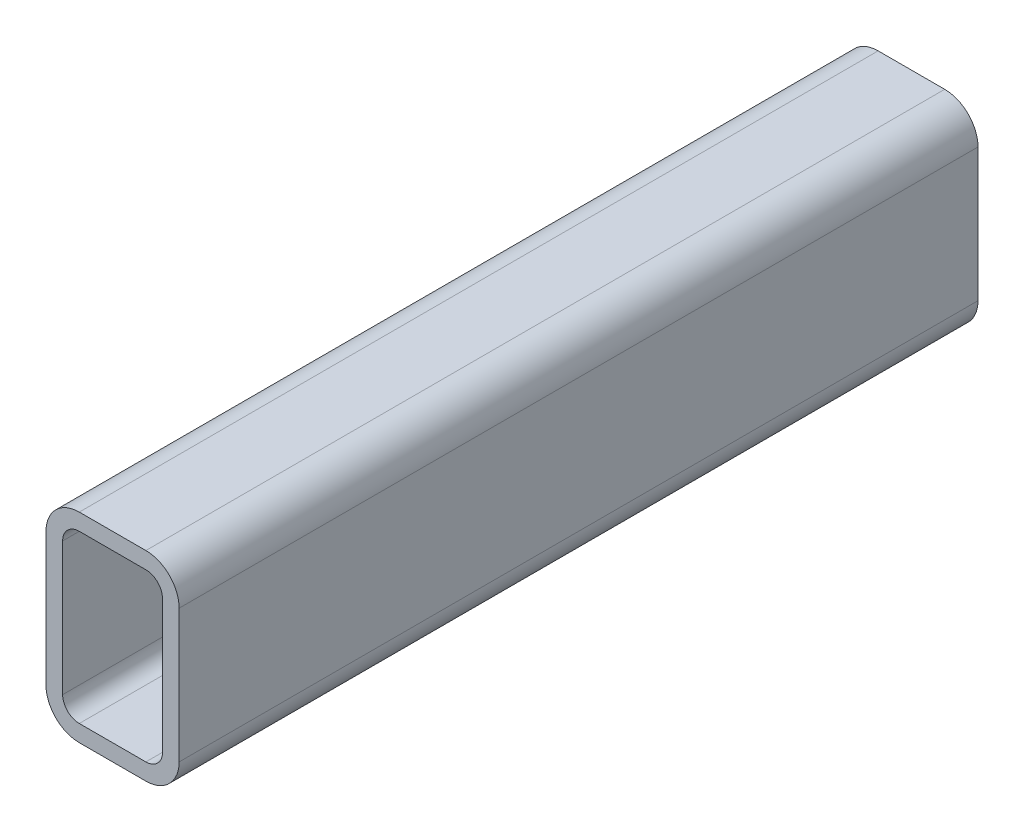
ISO-10303-21;
HEADER;
FILE_DESCRIPTION(('STEP AP214'),'2;1');
FILE_NAME('part.step','',(''),(''),'','','');
FILE_SCHEMA(('AUTOMOTIVE_DESIGN { 1 0 10303 214 1 1 1 1 }'));
ENDSEC;
DATA;
#1=APPLICATION_CONTEXT('core data for automotive mechanical design processes');
#2=APPLICATION_PROTOCOL_DEFINITION('international standard','automotive_design',2000,#1);
#3=PRODUCT_CONTEXT('',#1,'mechanical');
#4=PRODUCT('Part','Part','',(#3));
#5=PRODUCT_RELATED_PRODUCT_CATEGORY('part','',(#4));
#6=PRODUCT_DEFINITION_FORMATION('','',#4);
#7=PRODUCT_DEFINITION_CONTEXT('part definition',#1,'design');
#8=PRODUCT_DEFINITION('design','',#6,#7);
#9=PRODUCT_DEFINITION_SHAPE('','',#8);
#10=(LENGTH_UNIT() NAMED_UNIT(*) SI_UNIT(.MILLI.,.METRE.));
#11=(NAMED_UNIT(*) PLANE_ANGLE_UNIT() SI_UNIT($,.RADIAN.));
#12=(NAMED_UNIT(*) SI_UNIT($,.STERADIAN.) SOLID_ANGLE_UNIT());
#13=UNCERTAINTY_MEASURE_WITH_UNIT(LENGTH_MEASURE(1.E-05),#10,'distance_accuracy_value','');
#14=(GEOMETRIC_REPRESENTATION_CONTEXT(3) GLOBAL_UNCERTAINTY_ASSIGNED_CONTEXT((#13)) GLOBAL_UNIT_ASSIGNED_CONTEXT((#10,
#11,#12)) REPRESENTATION_CONTEXT('',''));
#15=CARTESIAN_POINT('',(0.,0.,0.));
#16=DIRECTION('',(0.,0.,1.));
#17=DIRECTION('',(1.,0.,0.));
#18=AXIS2_PLACEMENT_3D('',#15,#16,#17);
#19=CARTESIAN_POINT('',(12.7,63.5,304.8));
#20=DIRECTION('',(0.,0.,1.));
#21=DIRECTION('',(1.,0.,0.));
#22=AXIS2_PLACEMENT_3D('',#19,#20,#21);
#23=PLANE('',#22);
#24=CARTESIAN_POINT('',(12.7,63.5,304.8));
#25=DIRECTION('',(0.,0.,1.));
#26=DIRECTION('',(1.,0.,0.));
#27=AXIS2_PLACEMENT_3D('',#24,#25,#26);
#28=CIRCLE('',#27,12.7);
#29=CARTESIAN_POINT('',(12.7,76.2,304.8));
#30=VERTEX_POINT('',#29);
#31=CARTESIAN_POINT('',(0.,63.5,304.8));
#32=VERTEX_POINT('',#31);
#33=EDGE_CURVE('E211',#30,#32,#28,.T.);
#34=ORIENTED_EDGE('',*,*,#33,.T.);
#35=DIRECTION('',(0.,-1.,0.));
#36=VECTOR('',#35,1.);
#37=CARTESIAN_POINT('',(0.,12.7,304.8));
#38=LINE('',#37,#36);
#39=CARTESIAN_POINT('',(0.,12.7,304.8));
#40=VERTEX_POINT('',#39);
#41=EDGE_CURVE('E214',#32,#40,#38,.T.);
#42=ORIENTED_EDGE('',*,*,#41,.T.);
#43=CARTESIAN_POINT('',(12.7,12.7,304.8));
#44=DIRECTION('',(0.,0.,1.));
#45=DIRECTION('',(1.,0.,0.));
#46=AXIS2_PLACEMENT_3D('',#43,#44,#45);
#47=CIRCLE('',#46,12.7);
#48=CARTESIAN_POINT('',(12.7,0.,304.8));
#49=VERTEX_POINT('',#48);
#50=EDGE_CURVE('E217',#40,#49,#47,.T.);
#51=ORIENTED_EDGE('',*,*,#50,.T.);
#52=DIRECTION('',(1.,0.,0.));
#53=VECTOR('',#52,1.);
#54=CARTESIAN_POINT('',(38.1,0.,304.8));
#55=LINE('',#54,#53);
#56=CARTESIAN_POINT('',(38.1,0.,304.8));
#57=VERTEX_POINT('',#56);
#58=EDGE_CURVE('E219',#49,#57,#55,.T.);
#59=ORIENTED_EDGE('',*,*,#58,.T.);
#60=CARTESIAN_POINT('',(38.1,12.7,304.8));
#61=DIRECTION('',(0.,0.,1.));
#62=DIRECTION('',(1.,0.,0.));
#63=AXIS2_PLACEMENT_3D('',#60,#61,#62);
#64=CIRCLE('',#63,12.7);
#65=CARTESIAN_POINT('',(50.8,12.7,304.8));
#66=VERTEX_POINT('',#65);
#67=EDGE_CURVE('E221',#57,#66,#64,.T.);
#68=ORIENTED_EDGE('',*,*,#67,.T.);
#69=DIRECTION('',(0.,1.,0.));
#70=VECTOR('',#69,1.);
#71=CARTESIAN_POINT('',(50.8,63.5,304.8));
#72=LINE('',#71,#70);
#73=CARTESIAN_POINT('',(50.8,63.5,304.8));
#74=VERTEX_POINT('',#73);
#75=EDGE_CURVE('E223',#66,#74,#72,.T.);
#76=ORIENTED_EDGE('',*,*,#75,.T.);
#77=CARTESIAN_POINT('',(38.1,63.5,304.8));
#78=DIRECTION('',(0.,0.,1.));
#79=DIRECTION('',(1.,0.,0.));
#80=AXIS2_PLACEMENT_3D('',#77,#78,#79);
#81=CIRCLE('',#80,12.7);
#82=CARTESIAN_POINT('',(38.1,76.2,304.8));
#83=VERTEX_POINT('',#82);
#84=EDGE_CURVE('E225',#74,#83,#81,.T.);
#85=ORIENTED_EDGE('',*,*,#84,.T.);
#86=DIRECTION('',(-1.,0.,0.));
#87=VECTOR('',#86,1.);
#88=CARTESIAN_POINT('',(12.7,76.2,304.8));
#89=LINE('',#88,#87);
#90=EDGE_CURVE('E227',#83,#30,#89,.T.);
#91=ORIENTED_EDGE('',*,*,#90,.T.);
#92=EDGE_LOOP('',(#34,#42,#51,#59,#68,#76,#85,#91));
#93=FACE_BOUND('',#92,.T.);
#94=DIRECTION('',(0.,-1.,0.));
#95=VECTOR('',#94,1.);
#96=CARTESIAN_POINT('',(6.35,12.7,304.8));
#97=LINE('',#96,#95);
#98=CARTESIAN_POINT('',(6.35,63.5,304.8));
#99=VERTEX_POINT('',#98);
#100=CARTESIAN_POINT('',(6.35,12.7,304.8));
#101=VERTEX_POINT('',#100);
#102=EDGE_CURVE('E154',#99,#101,#97,.T.);
#103=ORIENTED_EDGE('',*,*,#102,.F.);
#104=CARTESIAN_POINT('',(12.7,63.5,304.8));
#105=DIRECTION('',(0.,0.,1.));
#106=DIRECTION('',(1.,0.,0.));
#107=AXIS2_PLACEMENT_3D('',#104,#105,#106);
#108=CIRCLE('',#107,6.35);
#109=CARTESIAN_POINT('',(12.7,69.85,304.8));
#110=VERTEX_POINT('',#109);
#111=EDGE_CURVE('E146',#110,#99,#108,.T.);
#112=ORIENTED_EDGE('',*,*,#111,.F.);
#113=DIRECTION('',(-1.,0.,0.));
#114=VECTOR('',#113,1.);
#115=CARTESIAN_POINT('',(12.7,69.85,304.8));
#116=LINE('',#115,#114);
#117=CARTESIAN_POINT('',(38.1,69.85,304.8));
#118=VERTEX_POINT('',#117);
#119=EDGE_CURVE('E179',#118,#110,#116,.T.);
#120=ORIENTED_EDGE('',*,*,#119,.F.);
#121=CARTESIAN_POINT('',(38.1,63.5,304.8));
#122=DIRECTION('',(0.,0.,1.));
#123=DIRECTION('',(1.,0.,0.));
#124=AXIS2_PLACEMENT_3D('',#121,#122,#123);
#125=CIRCLE('',#124,6.34999999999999);
#126=CARTESIAN_POINT('',(44.45,63.5,304.8));
#127=VERTEX_POINT('',#126);
#128=EDGE_CURVE('E177',#127,#118,#125,.T.);
#129=ORIENTED_EDGE('',*,*,#128,.F.);
#130=DIRECTION('',(0.,1.,0.));
#131=VECTOR('',#130,1.);
#132=CARTESIAN_POINT('',(44.45,63.5,304.8));
#133=LINE('',#132,#131);
#134=CARTESIAN_POINT('',(44.45,12.7,304.8));
#135=VERTEX_POINT('',#134);
#136=EDGE_CURVE('E175',#135,#127,#133,.T.);
#137=ORIENTED_EDGE('',*,*,#136,.F.);
#138=CARTESIAN_POINT('',(38.1,12.7,304.8));
#139=DIRECTION('',(0.,0.,1.));
#140=DIRECTION('',(1.,0.,0.));
#141=AXIS2_PLACEMENT_3D('',#138,#139,#140);
#142=CIRCLE('',#141,6.35);
#143=CARTESIAN_POINT('',(38.1,6.35000000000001,304.8));
#144=VERTEX_POINT('',#143);
#145=EDGE_CURVE('E173',#144,#135,#142,.T.);
#146=ORIENTED_EDGE('',*,*,#145,.F.);
#147=DIRECTION('',(1.,0.,0.));
#148=VECTOR('',#147,1.);
#149=CARTESIAN_POINT('',(38.1,6.35000000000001,304.8));
#150=LINE('',#149,#148);
#151=CARTESIAN_POINT('',(12.7,6.35000000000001,304.8));
#152=VERTEX_POINT('',#151);
#153=EDGE_CURVE('E169',#152,#144,#150,.T.);
#154=ORIENTED_EDGE('',*,*,#153,.F.);
#155=CARTESIAN_POINT('',(12.7,12.7,304.8));
#156=DIRECTION('',(0.,0.,1.));
#157=DIRECTION('',(1.,0.,0.));
#158=AXIS2_PLACEMENT_3D('',#155,#156,#157);
#159=CIRCLE('',#158,6.35);
#160=EDGE_CURVE('E167',#101,#152,#159,.T.);
#161=ORIENTED_EDGE('',*,*,#160,.F.);
#162=EDGE_LOOP('',(#103,#112,#120,#129,#137,#146,#154,#161));
#163=FACE_BOUND('',#162,.T.);
#164=ADVANCED_FACE('F33',(#93,#163),#23,.T.);
#165=CARTESIAN_POINT('',(12.7,63.5,0.));
#166=DIRECTION('',(0.,0.,1.));
#167=DIRECTION('',(1.,0.,0.));
#168=AXIS2_PLACEMENT_3D('',#165,#166,#167);
#169=PLANE('',#168);
#170=CARTESIAN_POINT('',(12.7,63.5,0.));
#171=DIRECTION('',(0.,0.,1.));
#172=DIRECTION('',(1.,0.,0.));
#173=AXIS2_PLACEMENT_3D('',#170,#171,#172);
#174=CIRCLE('',#173,12.7);
#175=CARTESIAN_POINT('',(12.7,76.2,0.));
#176=VERTEX_POINT('',#175);
#177=CARTESIAN_POINT('',(0.,63.5,0.));
#178=VERTEX_POINT('',#177);
#179=EDGE_CURVE('E162',#176,#178,#174,.T.);
#180=ORIENTED_EDGE('',*,*,#179,.F.);
#181=DIRECTION('',(-1.,0.,0.));
#182=VECTOR('',#181,1.);
#183=CARTESIAN_POINT('',(12.7,76.2,0.));
#184=LINE('',#183,#182);
#185=CARTESIAN_POINT('',(38.1,76.2,0.));
#186=VERTEX_POINT('',#185);
#187=EDGE_CURVE('E215',#186,#176,#184,.T.);
#188=ORIENTED_EDGE('',*,*,#187,.F.);
#189=CARTESIAN_POINT('',(38.1,63.5,0.));
#190=DIRECTION('',(0.,0.,1.));
#191=DIRECTION('',(1.,0.,0.));
#192=AXIS2_PLACEMENT_3D('',#189,#190,#191);
#193=CIRCLE('',#192,12.7);
#194=CARTESIAN_POINT('',(50.8,63.5,0.));
#195=VERTEX_POINT('',#194);
#196=EDGE_CURVE('E242',#195,#186,#193,.T.);
#197=ORIENTED_EDGE('',*,*,#196,.F.);
#198=DIRECTION('',(0.,1.,0.));
#199=VECTOR('',#198,1.);
#200=CARTESIAN_POINT('',(50.8,63.5,0.));
#201=LINE('',#200,#199);
#202=CARTESIAN_POINT('',(50.8,12.7,0.));
#203=VERTEX_POINT('',#202);
#204=EDGE_CURVE('E240',#203,#195,#201,.T.);
#205=ORIENTED_EDGE('',*,*,#204,.F.);
#206=CARTESIAN_POINT('',(38.1,12.7,0.));
#207=DIRECTION('',(0.,0.,1.));
#208=DIRECTION('',(1.,0.,0.));
#209=AXIS2_PLACEMENT_3D('',#206,#207,#208);
#210=CIRCLE('',#209,12.7);
#211=CARTESIAN_POINT('',(38.1,0.,0.));
#212=VERTEX_POINT('',#211);
#213=EDGE_CURVE('E238',#212,#203,#210,.T.);
#214=ORIENTED_EDGE('',*,*,#213,.F.);
#215=DIRECTION('',(1.,0.,0.));
#216=VECTOR('',#215,1.);
#217=CARTESIAN_POINT('',(38.1,0.,0.));
#218=LINE('',#217,#216);
#219=CARTESIAN_POINT('',(12.7,0.,0.));
#220=VERTEX_POINT('',#219);
#221=EDGE_CURVE('E236',#220,#212,#218,.T.);
#222=ORIENTED_EDGE('',*,*,#221,.F.);
#223=CARTESIAN_POINT('',(12.7,12.7,0.));
#224=DIRECTION('',(0.,0.,1.));
#225=DIRECTION('',(1.,0.,0.));
#226=AXIS2_PLACEMENT_3D('',#223,#224,#225);
#227=CIRCLE('',#226,12.7);
#228=CARTESIAN_POINT('',(0.,12.7,0.));
#229=VERTEX_POINT('',#228);
#230=EDGE_CURVE('E234',#229,#220,#227,.T.);
#231=ORIENTED_EDGE('',*,*,#230,.F.);
#232=DIRECTION('',(0.,-1.,0.));
#233=VECTOR('',#232,1.);
#234=CARTESIAN_POINT('',(0.,12.7,0.));
#235=LINE('',#234,#233);
#236=EDGE_CURVE('E232',#178,#229,#235,.T.);
#237=ORIENTED_EDGE('',*,*,#236,.F.);
#238=EDGE_LOOP('',(#180,#188,#197,#205,#214,#222,#231,#237));
#239=FACE_BOUND('',#238,.T.);
#240=CARTESIAN_POINT('',(12.7,63.5,0.));
#241=DIRECTION('',(0.,0.,1.));
#242=DIRECTION('',(1.,0.,0.));
#243=AXIS2_PLACEMENT_3D('',#240,#241,#242);
#244=CIRCLE('',#243,6.35);
#245=CARTESIAN_POINT('',(12.7,69.85,0.));
#246=VERTEX_POINT('',#245);
#247=CARTESIAN_POINT('',(6.35,63.5,0.));
#248=VERTEX_POINT('',#247);
#249=EDGE_CURVE('E56',#246,#248,#244,.T.);
#250=ORIENTED_EDGE('',*,*,#249,.T.);
#251=DIRECTION('',(0.,-1.,0.));
#252=VECTOR('',#251,1.);
#253=CARTESIAN_POINT('',(6.35,12.7,0.));
#254=LINE('',#253,#252);
#255=CARTESIAN_POINT('',(6.35,12.7,0.));
#256=VERTEX_POINT('',#255);
#257=EDGE_CURVE('E161',#248,#256,#254,.T.);
#258=ORIENTED_EDGE('',*,*,#257,.T.);
#259=CARTESIAN_POINT('',(12.7,12.7,0.));
#260=DIRECTION('',(0.,0.,1.));
#261=DIRECTION('',(1.,0.,0.));
#262=AXIS2_PLACEMENT_3D('',#259,#260,#261);
#263=CIRCLE('',#262,6.35);
#264=CARTESIAN_POINT('',(12.7,6.35000000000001,0.));
#265=VERTEX_POINT('',#264);
#266=EDGE_CURVE('E183',#256,#265,#263,.T.);
#267=ORIENTED_EDGE('',*,*,#266,.T.);
#268=DIRECTION('',(1.,0.,0.));
#269=VECTOR('',#268,1.);
#270=CARTESIAN_POINT('',(38.1,6.35000000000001,0.));
#271=LINE('',#270,#269);
#272=CARTESIAN_POINT('',(38.1,6.35000000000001,0.));
#273=VERTEX_POINT('',#272);
#274=EDGE_CURVE('E186',#265,#273,#271,.T.);
#275=ORIENTED_EDGE('',*,*,#274,.T.);
#276=CARTESIAN_POINT('',(38.1,12.7,0.));
#277=DIRECTION('',(0.,0.,1.));
#278=DIRECTION('',(1.,0.,0.));
#279=AXIS2_PLACEMENT_3D('',#276,#277,#278);
#280=CIRCLE('',#279,6.35);
#281=CARTESIAN_POINT('',(44.45,12.7,0.));
#282=VERTEX_POINT('',#281);
#283=EDGE_CURVE('E189',#273,#282,#280,.T.);
#284=ORIENTED_EDGE('',*,*,#283,.T.);
#285=DIRECTION('',(0.,1.,0.));
#286=VECTOR('',#285,1.);
#287=CARTESIAN_POINT('',(44.45,63.5,0.));
#288=LINE('',#287,#286);
#289=CARTESIAN_POINT('',(44.45,63.5,0.));
#290=VERTEX_POINT('',#289);
#291=EDGE_CURVE('E192',#282,#290,#288,.T.);
#292=ORIENTED_EDGE('',*,*,#291,.T.);
#293=CARTESIAN_POINT('',(38.1,63.5,0.));
#294=DIRECTION('',(0.,0.,1.));
#295=DIRECTION('',(1.,0.,0.));
#296=AXIS2_PLACEMENT_3D('',#293,#294,#295);
#297=CIRCLE('',#296,6.34999999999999);
#298=CARTESIAN_POINT('',(38.1,69.85,0.));
#299=VERTEX_POINT('',#298);
#300=EDGE_CURVE('E195',#290,#299,#297,.T.);
#301=ORIENTED_EDGE('',*,*,#300,.T.);
#302=DIRECTION('',(-1.,0.,0.));
#303=VECTOR('',#302,1.);
#304=CARTESIAN_POINT('',(12.7,69.85,0.));
#305=LINE('',#304,#303);
#306=EDGE_CURVE('E155',#299,#246,#305,.T.);
#307=ORIENTED_EDGE('',*,*,#306,.T.);
#308=EDGE_LOOP('',(#250,#258,#267,#275,#284,#292,#301,#307));
#309=FACE_BOUND('',#308,.T.);
#310=ADVANCED_FACE('F272',(#239,#309),#169,.F.);
#311=CARTESIAN_POINT('',(12.7,63.5,304.8));
#312=DIRECTION('',(0.,0.,-1.));
#313=DIRECTION('',(-1.,0.,0.));
#314=AXIS2_PLACEMENT_3D('',#311,#312,#313);
#315=CYLINDRICAL_SURFACE('',#314,12.7);
#316=ORIENTED_EDGE('',*,*,#179,.T.);
#317=DIRECTION('',(0.,0.,-1.));
#318=VECTOR('',#317,1.);
#319=CARTESIAN_POINT('',(0.,63.5,304.8));
#320=LINE('',#319,#318);
#321=EDGE_CURVE('E11',#32,#178,#320,.T.);
#322=ORIENTED_EDGE('',*,*,#321,.F.);
#323=ORIENTED_EDGE('',*,*,#33,.F.);
#324=DIRECTION('',(0.,0.,-1.));
#325=VECTOR('',#324,1.);
#326=CARTESIAN_POINT('',(12.7,76.2,304.8));
#327=LINE('',#326,#325);
#328=EDGE_CURVE('E229',#30,#176,#327,.T.);
#329=ORIENTED_EDGE('',*,*,#328,.T.);
#330=EDGE_LOOP('',(#316,#322,#323,#329));
#331=FACE_BOUND('',#330,.T.);
#332=ADVANCED_FACE('F35',(#331),#315,.T.);
#333=CARTESIAN_POINT('',(0.,12.7,304.8));
#334=DIRECTION('',(1.,0.,0.));
#335=DIRECTION('',(0.,0.,-1.));
#336=AXIS2_PLACEMENT_3D('',#333,#334,#335);
#337=PLANE('',#336);
#338=ORIENTED_EDGE('',*,*,#236,.T.);
#339=DIRECTION('',(0.,0.,-1.));
#340=VECTOR('',#339,1.);
#341=CARTESIAN_POINT('',(0.,12.7,304.8));
#342=LINE('',#341,#340);
#343=EDGE_CURVE('E41',#40,#229,#342,.T.);
#344=ORIENTED_EDGE('',*,*,#343,.F.);
#345=ORIENTED_EDGE('',*,*,#41,.F.);
#346=ORIENTED_EDGE('',*,*,#321,.T.);
#347=EDGE_LOOP('',(#338,#344,#345,#346));
#348=FACE_BOUND('',#347,.T.);
#349=ADVANCED_FACE('F289',(#348),#337,.F.);
#350=CARTESIAN_POINT('',(12.7,12.7,304.8));
#351=DIRECTION('',(0.,0.,-1.));
#352=DIRECTION('',(-1.,0.,0.));
#353=AXIS2_PLACEMENT_3D('',#350,#351,#352);
#354=CYLINDRICAL_SURFACE('',#353,12.7);
#355=ORIENTED_EDGE('',*,*,#230,.T.);
#356=DIRECTION('',(0.,0.,-1.));
#357=VECTOR('',#356,1.);
#358=CARTESIAN_POINT('',(12.7,0.,304.8));
#359=LINE('',#358,#357);
#360=EDGE_CURVE('E259',#49,#220,#359,.T.);
#361=ORIENTED_EDGE('',*,*,#360,.F.);
#362=ORIENTED_EDGE('',*,*,#50,.F.);
#363=ORIENTED_EDGE('',*,*,#343,.T.);
#364=EDGE_LOOP('',(#355,#361,#362,#363));
#365=FACE_BOUND('',#364,.T.);
#366=ADVANCED_FACE('F266',(#365),#354,.T.);
#367=CARTESIAN_POINT('',(38.1,0.,304.8));
#368=DIRECTION('',(0.,1.,0.));
#369=DIRECTION('',(0.,0.,1.));
#370=AXIS2_PLACEMENT_3D('',#367,#368,#369);
#371=PLANE('',#370);
#372=ORIENTED_EDGE('',*,*,#221,.T.);
#373=DIRECTION('',(0.,0.,-1.));
#374=VECTOR('',#373,1.);
#375=CARTESIAN_POINT('',(38.1,0.,304.8));
#376=LINE('',#375,#374);
#377=EDGE_CURVE('E256',#57,#212,#376,.T.);
#378=ORIENTED_EDGE('',*,*,#377,.F.);
#379=ORIENTED_EDGE('',*,*,#58,.F.);
#380=ORIENTED_EDGE('',*,*,#360,.T.);
#381=EDGE_LOOP('',(#372,#378,#379,#380));
#382=FACE_BOUND('',#381,.T.);
#383=ADVANCED_FACE('F278',(#382),#371,.F.);
#384=CARTESIAN_POINT('',(38.1,12.7,304.8));
#385=DIRECTION('',(0.,0.,-1.));
#386=DIRECTION('',(-1.,0.,0.));
#387=AXIS2_PLACEMENT_3D('',#384,#385,#386);
#388=CYLINDRICAL_SURFACE('',#387,12.7);
#389=ORIENTED_EDGE('',*,*,#213,.T.);
#390=DIRECTION('',(0.,0.,-1.));
#391=VECTOR('',#390,1.);
#392=CARTESIAN_POINT('',(50.8,12.7,304.8));
#393=LINE('',#392,#391);
#394=EDGE_CURVE('E253',#66,#203,#393,.T.);
#395=ORIENTED_EDGE('',*,*,#394,.F.);
#396=ORIENTED_EDGE('',*,*,#67,.F.);
#397=ORIENTED_EDGE('',*,*,#377,.T.);
#398=EDGE_LOOP('',(#389,#395,#396,#397));
#399=FACE_BOUND('',#398,.T.);
#400=ADVANCED_FACE('F282',(#399),#388,.T.);
#401=CARTESIAN_POINT('',(50.8,63.5,304.8));
#402=DIRECTION('',(-1.,0.,0.));
#403=DIRECTION('',(0.,0.,1.));
#404=AXIS2_PLACEMENT_3D('',#401,#402,#403);
#405=PLANE('',#404);
#406=ORIENTED_EDGE('',*,*,#204,.T.);
#407=DIRECTION('',(0.,0.,-1.));
#408=VECTOR('',#407,1.);
#409=CARTESIAN_POINT('',(50.8,63.5,304.8));
#410=LINE('',#409,#408);
#411=EDGE_CURVE('E250',#74,#195,#410,.T.);
#412=ORIENTED_EDGE('',*,*,#411,.F.);
#413=ORIENTED_EDGE('',*,*,#75,.F.);
#414=ORIENTED_EDGE('',*,*,#394,.T.);
#415=EDGE_LOOP('',(#406,#412,#413,#414));
#416=FACE_BOUND('',#415,.T.);
#417=ADVANCED_FACE('F302',(#416),#405,.F.);
#418=CARTESIAN_POINT('',(38.1,63.5,304.8));
#419=DIRECTION('',(0.,0.,-1.));
#420=DIRECTION('',(-1.,0.,0.));
#421=AXIS2_PLACEMENT_3D('',#418,#419,#420);
#422=CYLINDRICAL_SURFACE('',#421,12.7);
#423=ORIENTED_EDGE('',*,*,#196,.T.);
#424=DIRECTION('',(0.,0.,-1.));
#425=VECTOR('',#424,1.);
#426=CARTESIAN_POINT('',(38.1,76.2,304.8));
#427=LINE('',#426,#425);
#428=EDGE_CURVE('E247',#83,#186,#427,.T.);
#429=ORIENTED_EDGE('',*,*,#428,.F.);
#430=ORIENTED_EDGE('',*,*,#84,.F.);
#431=ORIENTED_EDGE('',*,*,#411,.T.);
#432=EDGE_LOOP('',(#423,#429,#430,#431));
#433=FACE_BOUND('',#432,.T.);
#434=ADVANCED_FACE('F300',(#433),#422,.T.);
#435=CARTESIAN_POINT('',(12.7,76.2,304.8));
#436=DIRECTION('',(0.,-1.,0.));
#437=DIRECTION('',(0.,0.,-1.));
#438=AXIS2_PLACEMENT_3D('',#435,#436,#437);
#439=PLANE('',#438);
#440=ORIENTED_EDGE('',*,*,#187,.T.);
#441=ORIENTED_EDGE('',*,*,#328,.F.);
#442=ORIENTED_EDGE('',*,*,#90,.F.);
#443=ORIENTED_EDGE('',*,*,#428,.T.);
#444=EDGE_LOOP('',(#440,#441,#442,#443));
#445=FACE_BOUND('',#444,.T.);
#446=ADVANCED_FACE('F295',(#445),#439,.F.);
#447=CARTESIAN_POINT('',(12.7,63.5,304.8));
#448=DIRECTION('',(0.,0.,-1.));
#449=DIRECTION('',(-1.,0.,0.));
#450=AXIS2_PLACEMENT_3D('',#447,#448,#449);
#451=CYLINDRICAL_SURFACE('',#450,6.35);
#452=ORIENTED_EDGE('',*,*,#249,.F.);
#453=DIRECTION('',(0.,0.,-1.));
#454=VECTOR('',#453,1.);
#455=CARTESIAN_POINT('',(12.7,69.85,304.8));
#456=LINE('',#455,#454);
#457=EDGE_CURVE('E150',#110,#246,#456,.T.);
#458=ORIENTED_EDGE('',*,*,#457,.F.);
#459=ORIENTED_EDGE('',*,*,#111,.T.);
#460=DIRECTION('',(0.,0.,-1.));
#461=VECTOR('',#460,1.);
#462=CARTESIAN_POINT('',(6.35,63.5,304.8));
#463=LINE('',#462,#461);
#464=EDGE_CURVE('E149',#99,#248,#463,.T.);
#465=ORIENTED_EDGE('',*,*,#464,.T.);
#466=EDGE_LOOP('',(#452,#458,#459,#465));
#467=FACE_BOUND('',#466,.T.);
#468=ADVANCED_FACE('F148',(#467),#451,.F.);
#469=CARTESIAN_POINT('',(6.35,12.7,304.8));
#470=DIRECTION('',(1.,0.,0.));
#471=DIRECTION('',(0.,0.,-1.));
#472=AXIS2_PLACEMENT_3D('',#469,#470,#471);
#473=PLANE('',#472);
#474=ORIENTED_EDGE('',*,*,#257,.F.);
#475=ORIENTED_EDGE('',*,*,#464,.F.);
#476=ORIENTED_EDGE('',*,*,#102,.T.);
#477=DIRECTION('',(0.,0.,-1.));
#478=VECTOR('',#477,1.);
#479=CARTESIAN_POINT('',(6.35,12.7,304.8));
#480=LINE('',#479,#478);
#481=EDGE_CURVE('E163',#101,#256,#480,.T.);
#482=ORIENTED_EDGE('',*,*,#481,.T.);
#483=EDGE_LOOP('',(#474,#475,#476,#482));
#484=FACE_BOUND('',#483,.T.);
#485=ADVANCED_FACE('F158',(#484),#473,.T.);
#486=CARTESIAN_POINT('',(12.7,12.7,304.8));
#487=DIRECTION('',(0.,0.,-1.));
#488=DIRECTION('',(-1.,0.,0.));
#489=AXIS2_PLACEMENT_3D('',#486,#487,#488);
#490=CYLINDRICAL_SURFACE('',#489,6.35);
#491=ORIENTED_EDGE('',*,*,#266,.F.);
#492=ORIENTED_EDGE('',*,*,#481,.F.);
#493=ORIENTED_EDGE('',*,*,#160,.T.);
#494=DIRECTION('',(0.,0.,-1.));
#495=VECTOR('',#494,1.);
#496=CARTESIAN_POINT('',(12.7,6.35000000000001,304.8));
#497=LINE('',#496,#495);
#498=EDGE_CURVE('E208',#152,#265,#497,.T.);
#499=ORIENTED_EDGE('',*,*,#498,.T.);
#500=EDGE_LOOP('',(#491,#492,#493,#499));
#501=FACE_BOUND('',#500,.T.);
#502=ADVANCED_FACE('F327',(#501),#490,.F.);
#503=CARTESIAN_POINT('',(38.1,6.35000000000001,304.8));
#504=DIRECTION('',(0.,1.,0.));
#505=DIRECTION('',(0.,0.,1.));
#506=AXIS2_PLACEMENT_3D('',#503,#504,#505);
#507=PLANE('',#506);
#508=ORIENTED_EDGE('',*,*,#274,.F.);
#509=ORIENTED_EDGE('',*,*,#498,.F.);
#510=ORIENTED_EDGE('',*,*,#153,.T.);
#511=DIRECTION('',(0.,0.,-1.));
#512=VECTOR('',#511,1.);
#513=CARTESIAN_POINT('',(38.1,6.35000000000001,304.8));
#514=LINE('',#513,#512);
#515=EDGE_CURVE('E206',#144,#273,#514,.T.);
#516=ORIENTED_EDGE('',*,*,#515,.T.);
#517=EDGE_LOOP('',(#508,#509,#510,#516));
#518=FACE_BOUND('',#517,.T.);
#519=ADVANCED_FACE('F331',(#518),#507,.T.);
#520=CARTESIAN_POINT('',(38.1,12.7,304.8));
#521=DIRECTION('',(0.,0.,-1.));
#522=DIRECTION('',(-1.,0.,0.));
#523=AXIS2_PLACEMENT_3D('',#520,#521,#522);
#524=CYLINDRICAL_SURFACE('',#523,6.35);
#525=ORIENTED_EDGE('',*,*,#283,.F.);
#526=ORIENTED_EDGE('',*,*,#515,.F.);
#527=ORIENTED_EDGE('',*,*,#145,.T.);
#528=DIRECTION('',(0.,0.,-1.));
#529=VECTOR('',#528,1.);
#530=CARTESIAN_POINT('',(44.45,12.7,304.8));
#531=LINE('',#530,#529);
#532=EDGE_CURVE('E204',#135,#282,#531,.T.);
#533=ORIENTED_EDGE('',*,*,#532,.T.);
#534=EDGE_LOOP('',(#525,#526,#527,#533));
#535=FACE_BOUND('',#534,.T.);
#536=ADVANCED_FACE('F337',(#535),#524,.F.);
#537=CARTESIAN_POINT('',(44.45,63.5,304.8));
#538=DIRECTION('',(-1.,0.,0.));
#539=DIRECTION('',(0.,0.,1.));
#540=AXIS2_PLACEMENT_3D('',#537,#538,#539);
#541=PLANE('',#540);
#542=ORIENTED_EDGE('',*,*,#291,.F.);
#543=ORIENTED_EDGE('',*,*,#532,.F.);
#544=ORIENTED_EDGE('',*,*,#136,.T.);
#545=DIRECTION('',(0.,0.,-1.));
#546=VECTOR('',#545,1.);
#547=CARTESIAN_POINT('',(44.45,63.5,304.8));
#548=LINE('',#547,#546);
#549=EDGE_CURVE('E202',#127,#290,#548,.T.);
#550=ORIENTED_EDGE('',*,*,#549,.T.);
#551=EDGE_LOOP('',(#542,#543,#544,#550));
#552=FACE_BOUND('',#551,.T.);
#553=ADVANCED_FACE('F341',(#552),#541,.T.);
#554=CARTESIAN_POINT('',(38.1,63.5,304.8));
#555=DIRECTION('',(0.,0.,-1.));
#556=DIRECTION('',(-1.,0.,0.));
#557=AXIS2_PLACEMENT_3D('',#554,#555,#556);
#558=CYLINDRICAL_SURFACE('',#557,6.34999999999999);
#559=ORIENTED_EDGE('',*,*,#300,.F.);
#560=ORIENTED_EDGE('',*,*,#549,.F.);
#561=ORIENTED_EDGE('',*,*,#128,.T.);
#562=DIRECTION('',(0.,0.,-1.));
#563=VECTOR('',#562,1.);
#564=CARTESIAN_POINT('',(38.1,69.85,304.8));
#565=LINE('',#564,#563);
#566=EDGE_CURVE('E48',#118,#299,#565,.T.);
#567=ORIENTED_EDGE('',*,*,#566,.T.);
#568=EDGE_LOOP('',(#559,#560,#561,#567));
#569=FACE_BOUND('',#568,.T.);
#570=ADVANCED_FACE('F345',(#569),#558,.F.);
#571=CARTESIAN_POINT('',(12.7,69.85,304.8));
#572=DIRECTION('',(0.,-1.,0.));
#573=DIRECTION('',(0.,0.,-1.));
#574=AXIS2_PLACEMENT_3D('',#571,#572,#573);
#575=PLANE('',#574);
#576=ORIENTED_EDGE('',*,*,#306,.F.);
#577=ORIENTED_EDGE('',*,*,#566,.F.);
#578=ORIENTED_EDGE('',*,*,#119,.T.);
#579=ORIENTED_EDGE('',*,*,#457,.T.);
#580=EDGE_LOOP('',(#576,#577,#578,#579));
#581=FACE_BOUND('',#580,.T.);
#582=ADVANCED_FACE('F349',(#581),#575,.T.);
#583=CLOSED_SHELL('',(#164,#310,#332,#349,#366,#383,#400,#417,#434,#446,#468,#485,#502,#519,
#536,#553,#570,#582));
#584=MANIFOLD_SOLID_BREP('B2',#583);
#585=ADVANCED_BREP_SHAPE_REPRESENTATION('',(#18,#584),#14);
#586=SHAPE_DEFINITION_REPRESENTATION(#9,#585);
ENDSEC;
END-ISO-10303-21;
